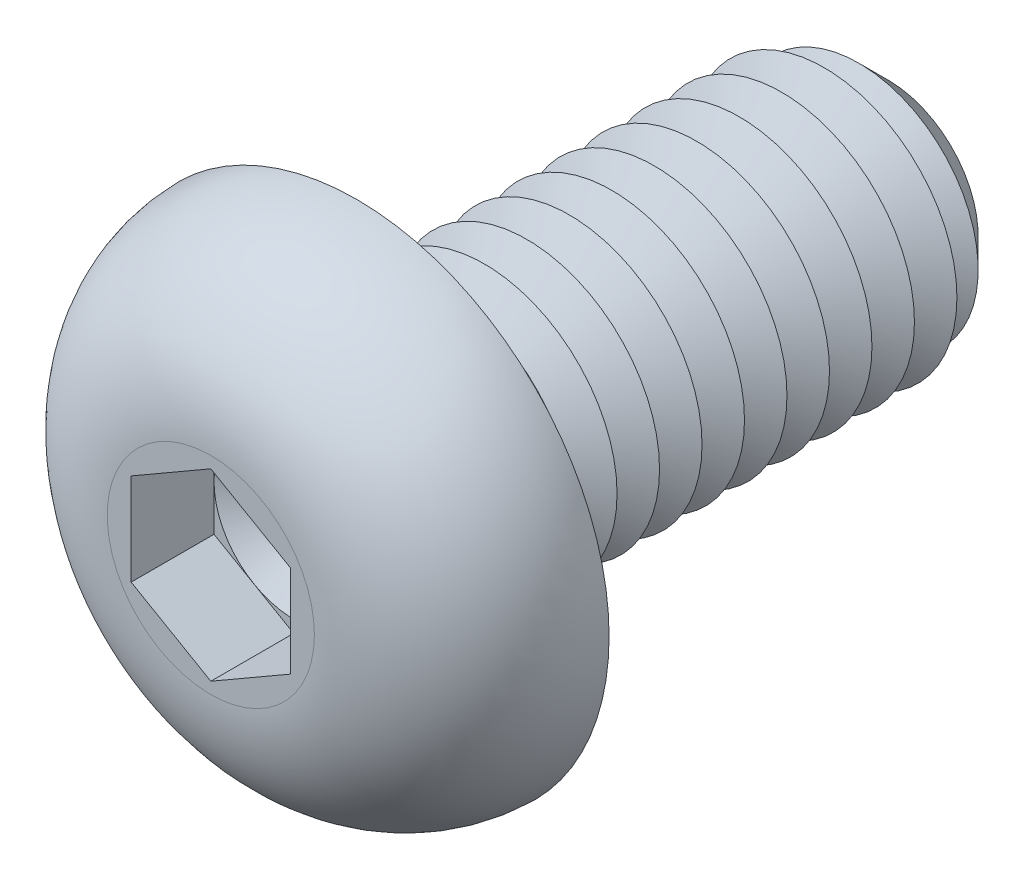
ISO-10303-21;
HEADER;
FILE_DESCRIPTION(('STEP AP214'),'2;1');
FILE_NAME('part.step','',(''),(''),'','','');
FILE_SCHEMA(('AUTOMOTIVE_DESIGN { 1 0 10303 214 1 1 1 1 }'));
ENDSEC;
DATA;
#1=APPLICATION_CONTEXT('core data for automotive mechanical design processes');
#2=APPLICATION_PROTOCOL_DEFINITION('international standard','automotive_design',2000,#1);
#3=PRODUCT_CONTEXT('',#1,'mechanical');
#4=PRODUCT('Part','Part','',(#3));
#5=PRODUCT_RELATED_PRODUCT_CATEGORY('part','',(#4));
#6=PRODUCT_DEFINITION_FORMATION('','',#4);
#7=PRODUCT_DEFINITION_CONTEXT('part definition',#1,'design');
#8=PRODUCT_DEFINITION('design','',#6,#7);
#9=PRODUCT_DEFINITION_SHAPE('','',#8);
#10=(LENGTH_UNIT() NAMED_UNIT(*) SI_UNIT(.MILLI.,.METRE.));
#11=(NAMED_UNIT(*) PLANE_ANGLE_UNIT() SI_UNIT($,.RADIAN.));
#12=(NAMED_UNIT(*) SI_UNIT($,.STERADIAN.) SOLID_ANGLE_UNIT());
#13=UNCERTAINTY_MEASURE_WITH_UNIT(LENGTH_MEASURE(1.E-05),#10,'distance_accuracy_value','');
#14=(GEOMETRIC_REPRESENTATION_CONTEXT(3) GLOBAL_UNCERTAINTY_ASSIGNED_CONTEXT((#13)) GLOBAL_UNIT_ASSIGNED_CONTEXT((#10,
#11,#12)) REPRESENTATION_CONTEXT('',''));
#15=CARTESIAN_POINT('',(0.,0.,0.));
#16=DIRECTION('',(0.,0.,1.));
#17=DIRECTION('',(1.,0.,0.));
#18=AXIS2_PLACEMENT_3D('',#15,#16,#17);
#19=CARTESIAN_POINT('',(0.,0.,1.19));
#20=DIRECTION('',(0.,0.,1.));
#21=DIRECTION('',(1.,0.,0.));
#22=AXIS2_PLACEMENT_3D('',#19,#20,#21);
#23=PLANE('',#22);
#24=CARTESIAN_POINT('',(0.,0.,1.19));
#25=DIRECTION('',(0.,0.,1.));
#26=DIRECTION('',(1.,0.,0.));
#27=AXIS2_PLACEMENT_3D('',#24,#25,#26);
#28=CIRCLE('',#27,1.5);
#29=CARTESIAN_POINT('',(1.5,0.,1.19));
#30=VERTEX_POINT('',#29);
#31=CARTESIAN_POINT('',(0.75,1.29903810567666,1.19));
#32=VERTEX_POINT('',#31);
#33=EDGE_CURVE('E117',#30,#32,#28,.T.);
#34=ORIENTED_EDGE('',*,*,#33,.F.);
#35=DIRECTION('',(0.,1.,0.));
#36=VECTOR('',#35,1.);
#37=CARTESIAN_POINT('',(1.5,-0.866025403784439,1.19));
#38=LINE('',#37,#36);
#39=CARTESIAN_POINT('',(1.5,0.86602540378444,1.19));
#40=VERTEX_POINT('',#39);
#41=EDGE_CURVE('E140',#30,#40,#38,.T.);
#42=ORIENTED_EDGE('',*,*,#41,.T.);
#43=DIRECTION('',(-0.866025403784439,0.5,0.));
#44=VECTOR('',#43,1.);
#45=CARTESIAN_POINT('',(1.5,0.86602540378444,1.19));
#46=LINE('',#45,#44);
#47=EDGE_CURVE('E135',#40,#32,#46,.T.);
#48=ORIENTED_EDGE('',*,*,#47,.T.);
#49=EDGE_LOOP('',(#34,#42,#48));
#50=FACE_BOUND('',#49,.T.);
#51=ADVANCED_FACE('F39',(#50),#23,.T.);
#52=CARTESIAN_POINT('',(0.,0.,1.19));
#53=DIRECTION('',(0.,0.,1.));
#54=DIRECTION('',(1.,0.,0.));
#55=AXIS2_PLACEMENT_3D('',#52,#53,#54);
#56=CIRCLE('',#55,1.5);
#57=CARTESIAN_POINT('',(-0.75,1.29903810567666,1.19));
#58=VERTEX_POINT('',#57);
#59=EDGE_CURVE('E11',#32,#58,#56,.T.);
#60=ORIENTED_EDGE('',*,*,#59,.F.);
#61=CARTESIAN_POINT('',(0.,1.73205080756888,1.19));
#62=VERTEX_POINT('',#61);
#63=EDGE_CURVE('E130',#32,#62,#46,.T.);
#64=ORIENTED_EDGE('',*,*,#63,.T.);
#65=DIRECTION('',(-0.866025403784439,-0.5,0.));
#66=VECTOR('',#65,1.);
#67=CARTESIAN_POINT('',(0.,1.73205080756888,1.19));
#68=LINE('',#67,#66);
#69=EDGE_CURVE('E132',#62,#58,#68,.T.);
#70=ORIENTED_EDGE('',*,*,#69,.T.);
#71=EDGE_LOOP('',(#60,#64,#70));
#72=FACE_BOUND('',#71,.T.);
#73=ADVANCED_FACE('F129',(#72),#23,.T.);
#74=CARTESIAN_POINT('',(-1.5,0.,1.19));
#75=VERTEX_POINT('',#74);
#76=EDGE_CURVE('E49',#58,#75,#56,.T.);
#77=ORIENTED_EDGE('',*,*,#76,.F.);
#78=CARTESIAN_POINT('',(-1.5,0.866025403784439,1.19));
#79=VERTEX_POINT('',#78);
#80=EDGE_CURVE('E143',#58,#79,#68,.T.);
#81=ORIENTED_EDGE('',*,*,#80,.T.);
#82=DIRECTION('',(0.,-1.,0.));
#83=VECTOR('',#82,1.);
#84=CARTESIAN_POINT('',(-1.5,0.866025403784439,1.19));
#85=LINE('',#84,#83);
#86=EDGE_CURVE('E154',#79,#75,#85,.T.);
#87=ORIENTED_EDGE('',*,*,#86,.T.);
#88=EDGE_LOOP('',(#77,#81,#87));
#89=FACE_BOUND('',#88,.T.);
#90=ADVANCED_FACE('F254',(#89),#23,.T.);
#91=CARTESIAN_POINT('',(-0.75,-1.29903810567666,1.19));
#92=VERTEX_POINT('',#91);
#93=EDGE_CURVE('E238',#75,#92,#56,.T.);
#94=ORIENTED_EDGE('',*,*,#93,.F.);
#95=CARTESIAN_POINT('',(-1.5,-0.866025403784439,1.19));
#96=VERTEX_POINT('',#95);
#97=EDGE_CURVE('E153',#75,#96,#85,.T.);
#98=ORIENTED_EDGE('',*,*,#97,.T.);
#99=DIRECTION('',(0.866025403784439,-0.5,0.));
#100=VECTOR('',#99,1.);
#101=CARTESIAN_POINT('',(-1.5,-0.866025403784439,1.19));
#102=LINE('',#101,#100);
#103=EDGE_CURVE('E159',#96,#92,#102,.T.);
#104=ORIENTED_EDGE('',*,*,#103,.T.);
#105=EDGE_LOOP('',(#94,#98,#104));
#106=FACE_BOUND('',#105,.T.);
#107=ADVANCED_FACE('F247',(#106),#23,.T.);
#108=CARTESIAN_POINT('',(0.75,-1.29903810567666,1.19));
#109=VERTEX_POINT('',#108);
#110=EDGE_CURVE('E56',#92,#109,#56,.T.);
#111=ORIENTED_EDGE('',*,*,#110,.F.);
#112=CARTESIAN_POINT('',(0.,-1.73205080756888,1.19));
#113=VERTEX_POINT('',#112);
#114=EDGE_CURVE('E158',#92,#113,#102,.T.);
#115=ORIENTED_EDGE('',*,*,#114,.T.);
#116=DIRECTION('',(0.866025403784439,0.5,0.));
#117=VECTOR('',#116,1.);
#118=CARTESIAN_POINT('',(0.,-1.73205080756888,1.19));
#119=LINE('',#118,#117);
#120=EDGE_CURVE('E164',#113,#109,#119,.T.);
#121=ORIENTED_EDGE('',*,*,#120,.T.);
#122=EDGE_LOOP('',(#111,#115,#121));
#123=FACE_BOUND('',#122,.T.);
#124=ADVANCED_FACE('F386',(#123),#23,.T.);
#125=CARTESIAN_POINT('',(0.,0.,-10.));
#126=DIRECTION('',(0.,0.,1.));
#127=DIRECTION('',(1.,0.,0.));
#128=AXIS2_PLACEMENT_3D('',#125,#126,#127);
#129=CYLINDRICAL_SURFACE('',#128,2.5);
#130=CARTESIAN_POINT('',(0.,0.,-0.399999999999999));
#131=DIRECTION('',(0.,0.,1.));
#132=DIRECTION('',(1.,0.,0.));
#133=AXIS2_PLACEMENT_3D('',#130,#131,#132);
#134=CIRCLE('',#133,2.5);
#135=CARTESIAN_POINT('',(2.5,0.,-0.399999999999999));
#136=VERTEX_POINT('',#135);
#137=EDGE_CURVE('E222',#136,#136,#134,.F.);
#138=ORIENTED_EDGE('',*,*,#137,.T.);
#139=EDGE_LOOP('',(#138));
#140=FACE_BOUND('',#139,.T.);
#141=CARTESIAN_POINT('',(0.,0.,-0.800000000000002));
#142=DIRECTION('',(0.,0.,1.));
#143=DIRECTION('',(1.,0.,0.));
#144=AXIS2_PLACEMENT_3D('',#141,#142,#143);
#145=CIRCLE('',#144,2.5);
#146=CARTESIAN_POINT('',(2.5,0.,-0.800000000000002));
#147=VERTEX_POINT('',#146);
#148=EDGE_CURVE('E149',#147,#147,#145,.T.);
#149=ORIENTED_EDGE('',*,*,#148,.T.);
#150=EDGE_LOOP('',(#149));
#151=FACE_BOUND('',#150,.T.);
#152=ADVANCED_FACE('F395',(#140,#151),#129,.T.);
#153=CARTESIAN_POINT('',(0.,4.75,0.));
#154=DIRECTION('',(0.,0.,1.));
#155=DIRECTION('',(1.,0.,0.));
#156=AXIS2_PLACEMENT_3D('',#153,#154,#155);
#157=PLANE('',#156);
#158=CARTESIAN_POINT('',(0.,0.,0.));
#159=DIRECTION('',(0.,0.,1.));
#160=DIRECTION('',(1.,0.,0.));
#161=AXIS2_PLACEMENT_3D('',#158,#159,#160);
#162=CIRCLE('',#161,2.9);
#163=CARTESIAN_POINT('',(2.9,0.,0.));
#164=VERTEX_POINT('',#163);
#165=EDGE_CURVE('E230',#164,#164,#162,.T.);
#166=ORIENTED_EDGE('',*,*,#165,.T.);
#167=EDGE_LOOP('',(#166));
#168=FACE_BOUND('',#167,.T.);
#169=CARTESIAN_POINT('',(0.,0.,0.));
#170=DIRECTION('',(0.,0.,1.));
#171=DIRECTION('',(1.,0.,0.));
#172=AXIS2_PLACEMENT_3D('',#169,#170,#171);
#173=CIRCLE('',#172,4.75);
#174=CARTESIAN_POINT('',(4.75,0.,0.));
#175=VERTEX_POINT('',#174);
#176=EDGE_CURVE('E196',#175,#175,#173,.T.);
#177=ORIENTED_EDGE('',*,*,#176,.F.);
#178=EDGE_LOOP('',(#177));
#179=FACE_BOUND('',#178,.T.);
#180=ADVANCED_FACE('F400',(#168,#179),#157,.F.);
#181=CARTESIAN_POINT('',(0.,0.,2.75));
#182=DIRECTION('',(0.,0.,-1.));
#183=DIRECTION('',(-1.,0.,0.));
#184=AXIS2_PLACEMENT_3D('',#181,#182,#183);
#185=PLANE('',#184);
#186=DIRECTION('',(-0.866025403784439,-0.5,0.));
#187=VECTOR('',#186,1.);
#188=CARTESIAN_POINT('',(0.,1.73205080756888,2.75));
#189=LINE('',#188,#187);
#190=CARTESIAN_POINT('',(0.,1.73205080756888,2.75));
#191=VERTEX_POINT('',#190);
#192=CARTESIAN_POINT('',(-1.5,0.866025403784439,2.75));
#193=VERTEX_POINT('',#192);
#194=EDGE_CURVE('E174',#191,#193,#189,.T.);
#195=ORIENTED_EDGE('',*,*,#194,.F.);
#196=DIRECTION('',(-0.866025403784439,0.5,0.));
#197=VECTOR('',#196,1.);
#198=CARTESIAN_POINT('',(1.5,0.86602540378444,2.75));
#199=LINE('',#198,#197);
#200=CARTESIAN_POINT('',(1.5,0.86602540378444,2.75));
#201=VERTEX_POINT('',#200);
#202=EDGE_CURVE('E64',#201,#191,#199,.T.);
#203=ORIENTED_EDGE('',*,*,#202,.F.);
#204=DIRECTION('',(0.,1.,0.));
#205=VECTOR('',#204,1.);
#206=CARTESIAN_POINT('',(1.5,-0.866025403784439,2.75));
#207=LINE('',#206,#205);
#208=CARTESIAN_POINT('',(1.5,-0.866025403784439,2.75));
#209=VERTEX_POINT('',#208);
#210=EDGE_CURVE('E138',#209,#201,#207,.T.);
#211=ORIENTED_EDGE('',*,*,#210,.F.);
#212=DIRECTION('',(0.866025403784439,0.5,0.));
#213=VECTOR('',#212,1.);
#214=CARTESIAN_POINT('',(0.,-1.73205080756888,2.75));
#215=LINE('',#214,#213);
#216=CARTESIAN_POINT('',(0.,-1.73205080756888,2.75));
#217=VERTEX_POINT('',#216);
#218=EDGE_CURVE('E186',#217,#209,#215,.T.);
#219=ORIENTED_EDGE('',*,*,#218,.F.);
#220=DIRECTION('',(0.866025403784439,-0.5,0.));
#221=VECTOR('',#220,1.);
#222=CARTESIAN_POINT('',(-1.5,-0.866025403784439,2.75));
#223=LINE('',#222,#221);
#224=CARTESIAN_POINT('',(-1.5,-0.866025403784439,2.75));
#225=VERTEX_POINT('',#224);
#226=EDGE_CURVE('E182',#225,#217,#223,.T.);
#227=ORIENTED_EDGE('',*,*,#226,.F.);
#228=DIRECTION('',(0.,-1.,0.));
#229=VECTOR('',#228,1.);
#230=CARTESIAN_POINT('',(-1.5,0.866025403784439,2.75));
#231=LINE('',#230,#229);
#232=EDGE_CURVE('E178',#193,#225,#231,.T.);
#233=ORIENTED_EDGE('',*,*,#232,.F.);
#234=EDGE_LOOP('',(#195,#203,#211,#219,#227,#233));
#235=FACE_BOUND('',#234,.T.);
#236=CARTESIAN_POINT('',(0.,0.,2.75));
#237=DIRECTION('',(0.,0.,1.));
#238=DIRECTION('',(1.,0.,0.));
#239=AXIS2_PLACEMENT_3D('',#236,#237,#238);
#240=CIRCLE('',#239,1.95044646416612);
#241=CARTESIAN_POINT('',(1.95044646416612,0.,2.75));
#242=VERTEX_POINT('',#241);
#243=EDGE_CURVE('E214',#242,#242,#240,.T.);
#244=ORIENTED_EDGE('',*,*,#243,.T.);
#245=EDGE_LOOP('',(#244));
#246=FACE_BOUND('',#245,.T.);
#247=ADVANCED_FACE('F263',(#235,#246),#185,.F.);
#248=CARTESIAN_POINT('',(0.,0.,-0.0500000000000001));
#249=DIRECTION('',(0.,0.,1.));
#250=DIRECTION('',(1.,0.,0.));
#251=AXIS2_PLACEMENT_3D('',#248,#249,#250);
#252=DEGENERATE_TOROIDAL_SURFACE('',#251,1.95044646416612,2.8,.T.);
#253=ORIENTED_EDGE('',*,*,#243,.F.);
#254=EDGE_LOOP('',(#253));
#255=FACE_BOUND('',#254,.T.);
#256=ORIENTED_EDGE('',*,*,#176,.T.);
#257=EDGE_LOOP('',(#256));
#258=FACE_BOUND('',#257,.T.);
#259=ADVANCED_FACE('F416',(#255,#258),#252,.T.);
#260=CARTESIAN_POINT('',(1.5,0.86602540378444,1.19));
#261=DIRECTION('',(0.5,0.866025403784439,0.));
#262=DIRECTION('',(-0.866025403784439,0.5,0.));
#263=AXIS2_PLACEMENT_3D('',#260,#261,#262);
#264=PLANE('',#263);
#265=ORIENTED_EDGE('',*,*,#202,.T.);
#266=DIRECTION('',(0.,0.,1.));
#267=VECTOR('',#266,1.);
#268=CARTESIAN_POINT('',(0.,1.73205080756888,1.19));
#269=LINE('',#268,#267);
#270=EDGE_CURVE('E136',#62,#191,#269,.T.);
#271=ORIENTED_EDGE('',*,*,#270,.F.);
#272=ORIENTED_EDGE('',*,*,#63,.F.);
#273=ORIENTED_EDGE('',*,*,#47,.F.);
#274=DIRECTION('',(0.,0.,1.));
#275=VECTOR('',#274,1.);
#276=CARTESIAN_POINT('',(1.5,0.86602540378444,1.19));
#277=LINE('',#276,#275);
#278=EDGE_CURVE('E193',#40,#201,#277,.T.);
#279=ORIENTED_EDGE('',*,*,#278,.T.);
#280=EDGE_LOOP('',(#265,#271,#272,#273,#279));
#281=FACE_BOUND('',#280,.T.);
#282=ADVANCED_FACE('F134',(#281),#264,.F.);
#283=CARTESIAN_POINT('',(1.5,-0.866025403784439,1.19));
#284=DIRECTION('',(1.,0.,0.));
#285=DIRECTION('',(0.,1.,0.));
#286=AXIS2_PLACEMENT_3D('',#283,#284,#285);
#287=PLANE('',#286);
#288=ORIENTED_EDGE('',*,*,#210,.T.);
#289=ORIENTED_EDGE('',*,*,#278,.F.);
#290=ORIENTED_EDGE('',*,*,#41,.F.);
#291=CARTESIAN_POINT('',(1.5,-0.866025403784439,1.19));
#292=VERTEX_POINT('',#291);
#293=EDGE_CURVE('E168',#292,#30,#38,.T.);
#294=ORIENTED_EDGE('',*,*,#293,.F.);
#295=DIRECTION('',(0.,0.,1.));
#296=VECTOR('',#295,1.);
#297=CARTESIAN_POINT('',(1.5,-0.866025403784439,1.19));
#298=LINE('',#297,#296);
#299=EDGE_CURVE('E197',#292,#209,#298,.T.);
#300=ORIENTED_EDGE('',*,*,#299,.T.);
#301=EDGE_LOOP('',(#288,#289,#290,#294,#300));
#302=FACE_BOUND('',#301,.T.);
#303=ADVANCED_FACE('F409',(#302),#287,.F.);
#304=CARTESIAN_POINT('',(0.,-1.73205080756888,1.19));
#305=DIRECTION('',(0.5,-0.866025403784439,0.));
#306=DIRECTION('',(0.866025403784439,0.5,0.));
#307=AXIS2_PLACEMENT_3D('',#304,#305,#306);
#308=PLANE('',#307);
#309=ORIENTED_EDGE('',*,*,#218,.T.);
#310=ORIENTED_EDGE('',*,*,#299,.F.);
#311=EDGE_CURVE('E163',#109,#292,#119,.T.);
#312=ORIENTED_EDGE('',*,*,#311,.F.);
#313=ORIENTED_EDGE('',*,*,#120,.F.);
#314=DIRECTION('',(0.,0.,1.));
#315=VECTOR('',#314,1.);
#316=CARTESIAN_POINT('',(0.,-1.73205080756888,1.19));
#317=LINE('',#316,#315);
#318=EDGE_CURVE('E200',#113,#217,#317,.T.);
#319=ORIENTED_EDGE('',*,*,#318,.T.);
#320=EDGE_LOOP('',(#309,#310,#312,#313,#319));
#321=FACE_BOUND('',#320,.T.);
#322=ADVANCED_FACE('F404',(#321),#308,.F.);
#323=CARTESIAN_POINT('',(-1.5,-0.866025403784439,1.19));
#324=DIRECTION('',(-0.5,-0.866025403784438,0.));
#325=DIRECTION('',(0.866025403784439,-0.5,0.));
#326=AXIS2_PLACEMENT_3D('',#323,#324,#325);
#327=PLANE('',#326);
#328=ORIENTED_EDGE('',*,*,#226,.T.);
#329=ORIENTED_EDGE('',*,*,#318,.F.);
#330=ORIENTED_EDGE('',*,*,#114,.F.);
#331=ORIENTED_EDGE('',*,*,#103,.F.);
#332=DIRECTION('',(0.,0.,1.));
#333=VECTOR('',#332,1.);
#334=CARTESIAN_POINT('',(-1.5,-0.866025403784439,1.19));
#335=LINE('',#334,#333);
#336=EDGE_CURVE('E203',#96,#225,#335,.T.);
#337=ORIENTED_EDGE('',*,*,#336,.T.);
#338=EDGE_LOOP('',(#328,#329,#330,#331,#337));
#339=FACE_BOUND('',#338,.T.);
#340=ADVANCED_FACE('F268',(#339),#327,.F.);
#341=CARTESIAN_POINT('',(-1.5,0.866025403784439,1.19));
#342=DIRECTION('',(-1.,0.,0.));
#343=DIRECTION('',(0.,-1.,0.));
#344=AXIS2_PLACEMENT_3D('',#341,#342,#343);
#345=PLANE('',#344);
#346=ORIENTED_EDGE('',*,*,#232,.T.);
#347=ORIENTED_EDGE('',*,*,#336,.F.);
#348=ORIENTED_EDGE('',*,*,#97,.F.);
#349=ORIENTED_EDGE('',*,*,#86,.F.);
#350=DIRECTION('',(0.,0.,1.));
#351=VECTOR('',#350,1.);
#352=CARTESIAN_POINT('',(-1.5,0.866025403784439,1.19));
#353=LINE('',#352,#351);
#354=EDGE_CURVE('E206',#79,#193,#353,.T.);
#355=ORIENTED_EDGE('',*,*,#354,.T.);
#356=EDGE_LOOP('',(#346,#347,#348,#349,#355));
#357=FACE_BOUND('',#356,.T.);
#358=ADVANCED_FACE('F252',(#357),#345,.F.);
#359=CARTESIAN_POINT('',(0.,1.73205080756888,1.19));
#360=DIRECTION('',(-0.5,0.866025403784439,0.));
#361=DIRECTION('',(-0.866025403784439,-0.5,0.));
#362=AXIS2_PLACEMENT_3D('',#359,#360,#361);
#363=PLANE('',#362);
#364=ORIENTED_EDGE('',*,*,#194,.T.);
#365=ORIENTED_EDGE('',*,*,#354,.F.);
#366=ORIENTED_EDGE('',*,*,#80,.F.);
#367=ORIENTED_EDGE('',*,*,#69,.F.);
#368=ORIENTED_EDGE('',*,*,#270,.T.);
#369=EDGE_LOOP('',(#364,#365,#366,#367,#368));
#370=FACE_BOUND('',#369,.T.);
#371=ADVANCED_FACE('F257',(#370),#363,.F.);
#372=EDGE_CURVE('E43',#109,#30,#56,.T.);
#373=ORIENTED_EDGE('',*,*,#372,.F.);
#374=ORIENTED_EDGE('',*,*,#311,.T.);
#375=ORIENTED_EDGE('',*,*,#293,.T.);
#376=EDGE_LOOP('',(#373,#374,#375));
#377=FACE_BOUND('',#376,.T.);
#378=ADVANCED_FACE('F377',(#377),#23,.T.);
#379=CARTESIAN_POINT('',(0.,0.,-0.800000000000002));
#380=DIRECTION('',(0.,0.,1.));
#381=DIRECTION('',(1.,0.,0.));
#382=AXIS2_PLACEMENT_3D('',#379,#380,#381);
#383=CONICAL_SURFACE('',#382,2.5,1.0471975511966);
#384=CARTESIAN_POINT('',(0.,0.,-1.2));
#385=DIRECTION('',(0.,0.,1.));
#386=DIRECTION('',(1.,0.,0.));
#387=AXIS2_PLACEMENT_3D('',#384,#385,#386);
#388=CIRCLE('',#387,1.80717967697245);
#389=CARTESIAN_POINT('',(1.80717967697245,0.,-1.2));
#390=VERTEX_POINT('',#389);
#391=EDGE_CURVE('E287',#390,#390,#388,.T.);
#392=ORIENTED_EDGE('',*,*,#391,.T.);
#393=EDGE_LOOP('',(#392));
#394=FACE_BOUND('',#393,.T.);
#395=ORIENTED_EDGE('',*,*,#148,.F.);
#396=EDGE_LOOP('',(#395));
#397=FACE_BOUND('',#396,.T.);
#398=ADVANCED_FACE('F384',(#394,#397),#383,.T.);
#399=CARTESIAN_POINT('',(0.,0.,-1.2));
#400=DIRECTION('',(0.,0.,-1.));
#401=DIRECTION('',(-1.,0.,0.));
#402=AXIS2_PLACEMENT_3D('',#399,#400,#401);
#403=CONICAL_SURFACE('',#402,1.80717967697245,1.04719755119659);
#404=CARTESIAN_POINT('',(0.,0.,-1.6));
#405=DIRECTION('',(0.,0.,1.));
#406=DIRECTION('',(1.,0.,0.));
#407=AXIS2_PLACEMENT_3D('',#404,#405,#406);
#408=CIRCLE('',#407,2.5);
#409=CARTESIAN_POINT('',(2.5,0.,-1.6));
#410=VERTEX_POINT('',#409);
#411=EDGE_CURVE('E289',#410,#410,#408,.T.);
#412=ORIENTED_EDGE('',*,*,#411,.T.);
#413=EDGE_LOOP('',(#412));
#414=FACE_BOUND('',#413,.T.);
#415=ORIENTED_EDGE('',*,*,#391,.F.);
#416=EDGE_LOOP('',(#415));
#417=FACE_BOUND('',#416,.T.);
#418=ADVANCED_FACE('F391',(#414,#417),#403,.T.);
#419=CARTESIAN_POINT('',(0.,0.,-1.6));
#420=DIRECTION('',(0.,0.,1.));
#421=DIRECTION('',(1.,0.,0.));
#422=AXIS2_PLACEMENT_3D('',#419,#420,#421);
#423=CONICAL_SURFACE('',#422,2.5,1.0471975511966);
#424=CARTESIAN_POINT('',(0.,0.,-2.));
#425=DIRECTION('',(0.,0.,1.));
#426=DIRECTION('',(1.,0.,0.));
#427=AXIS2_PLACEMENT_3D('',#424,#425,#426);
#428=CIRCLE('',#427,1.80717967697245);
#429=CARTESIAN_POINT('',(1.80717967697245,0.,-2.));
#430=VERTEX_POINT('',#429);
#431=EDGE_CURVE('E296',#430,#430,#428,.T.);
#432=ORIENTED_EDGE('',*,*,#431,.T.);
#433=EDGE_LOOP('',(#432));
#434=FACE_BOUND('',#433,.T.);
#435=ORIENTED_EDGE('',*,*,#411,.F.);
#436=EDGE_LOOP('',(#435));
#437=FACE_BOUND('',#436,.T.);
#438=ADVANCED_FACE('F729',(#434,#437),#423,.T.);
#439=CARTESIAN_POINT('',(0.,0.,-2.));
#440=DIRECTION('',(0.,0.,-1.));
#441=DIRECTION('',(-1.,0.,0.));
#442=AXIS2_PLACEMENT_3D('',#439,#440,#441);
#443=CONICAL_SURFACE('',#442,1.80717967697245,1.04719755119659);
#444=CARTESIAN_POINT('',(0.,0.,-2.4));
#445=DIRECTION('',(0.,0.,1.));
#446=DIRECTION('',(1.,0.,0.));
#447=AXIS2_PLACEMENT_3D('',#444,#445,#446);
#448=CIRCLE('',#447,2.5);
#449=CARTESIAN_POINT('',(2.5,0.,-2.4));
#450=VERTEX_POINT('',#449);
#451=EDGE_CURVE('E277',#450,#450,#448,.T.);
#452=ORIENTED_EDGE('',*,*,#451,.T.);
#453=EDGE_LOOP('',(#452));
#454=FACE_BOUND('',#453,.T.);
#455=ORIENTED_EDGE('',*,*,#431,.F.);
#456=EDGE_LOOP('',(#455));
#457=FACE_BOUND('',#456,.T.);
#458=ADVANCED_FACE('F719',(#454,#457),#443,.T.);
#459=CARTESIAN_POINT('',(0.,0.,-2.4));
#460=DIRECTION('',(0.,0.,1.));
#461=DIRECTION('',(1.,0.,0.));
#462=AXIS2_PLACEMENT_3D('',#459,#460,#461);
#463=CONICAL_SURFACE('',#462,2.5,1.0471975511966);
#464=CARTESIAN_POINT('',(0.,0.,-2.8));
#465=DIRECTION('',(0.,0.,1.));
#466=DIRECTION('',(1.,0.,0.));
#467=AXIS2_PLACEMENT_3D('',#464,#465,#466);
#468=CIRCLE('',#467,1.80717967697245);
#469=CARTESIAN_POINT('',(1.80717967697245,0.,-2.8));
#470=VERTEX_POINT('',#469);
#471=EDGE_CURVE('E275',#470,#470,#468,.T.);
#472=ORIENTED_EDGE('',*,*,#471,.T.);
#473=EDGE_LOOP('',(#472));
#474=FACE_BOUND('',#473,.T.);
#475=ORIENTED_EDGE('',*,*,#451,.F.);
#476=EDGE_LOOP('',(#475));
#477=FACE_BOUND('',#476,.T.);
#478=ADVANCED_FACE('F709',(#474,#477),#463,.T.);
#479=CARTESIAN_POINT('',(0.,0.,-2.8));
#480=DIRECTION('',(0.,0.,-1.));
#481=DIRECTION('',(-1.,0.,0.));
#482=AXIS2_PLACEMENT_3D('',#479,#480,#481);
#483=CONICAL_SURFACE('',#482,1.80717967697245,1.04719755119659);
#484=CARTESIAN_POINT('',(0.,0.,-3.2));
#485=DIRECTION('',(0.,0.,1.));
#486=DIRECTION('',(1.,0.,0.));
#487=AXIS2_PLACEMENT_3D('',#484,#485,#486);
#488=CIRCLE('',#487,2.5);
#489=CARTESIAN_POINT('',(2.5,0.,-3.2));
#490=VERTEX_POINT('',#489);
#491=EDGE_CURVE('E278',#490,#490,#488,.T.);
#492=ORIENTED_EDGE('',*,*,#491,.T.);
#493=EDGE_LOOP('',(#492));
#494=FACE_BOUND('',#493,.T.);
#495=ORIENTED_EDGE('',*,*,#471,.F.);
#496=EDGE_LOOP('',(#495));
#497=FACE_BOUND('',#496,.T.);
#498=ADVANCED_FACE('F699',(#494,#497),#483,.T.);
#499=CARTESIAN_POINT('',(0.,0.,-3.2));
#500=DIRECTION('',(0.,0.,1.));
#501=DIRECTION('',(1.,0.,0.));
#502=AXIS2_PLACEMENT_3D('',#499,#500,#501);
#503=CONICAL_SURFACE('',#502,2.5,1.0471975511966);
#504=CARTESIAN_POINT('',(0.,0.,-3.6));
#505=DIRECTION('',(0.,0.,1.));
#506=DIRECTION('',(1.,0.,0.));
#507=AXIS2_PLACEMENT_3D('',#504,#505,#506);
#508=CIRCLE('',#507,1.80717967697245);
#509=CARTESIAN_POINT('',(1.80717967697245,0.,-3.6));
#510=VERTEX_POINT('',#509);
#511=EDGE_CURVE('E308',#510,#510,#508,.T.);
#512=ORIENTED_EDGE('',*,*,#511,.T.);
#513=EDGE_LOOP('',(#512));
#514=FACE_BOUND('',#513,.T.);
#515=ORIENTED_EDGE('',*,*,#491,.F.);
#516=EDGE_LOOP('',(#515));
#517=FACE_BOUND('',#516,.T.);
#518=ADVANCED_FACE('F689',(#514,#517),#503,.T.);
#519=CARTESIAN_POINT('',(0.,0.,-3.6));
#520=DIRECTION('',(0.,0.,-1.));
#521=DIRECTION('',(-1.,0.,0.));
#522=AXIS2_PLACEMENT_3D('',#519,#520,#521);
#523=CONICAL_SURFACE('',#522,1.80717967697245,1.04719755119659);
#524=CARTESIAN_POINT('',(0.,0.,-4.));
#525=DIRECTION('',(0.,0.,1.));
#526=DIRECTION('',(1.,0.,0.));
#527=AXIS2_PLACEMENT_3D('',#524,#525,#526);
#528=CIRCLE('',#527,2.5);
#529=CARTESIAN_POINT('',(2.5,0.,-4.));
#530=VERTEX_POINT('',#529);
#531=EDGE_CURVE('E312',#530,#530,#528,.T.);
#532=ORIENTED_EDGE('',*,*,#531,.T.);
#533=EDGE_LOOP('',(#532));
#534=FACE_BOUND('',#533,.T.);
#535=ORIENTED_EDGE('',*,*,#511,.F.);
#536=EDGE_LOOP('',(#535));
#537=FACE_BOUND('',#536,.T.);
#538=ADVANCED_FACE('F679',(#534,#537),#523,.T.);
#539=CARTESIAN_POINT('',(0.,0.,-4.));
#540=DIRECTION('',(0.,0.,1.));
#541=DIRECTION('',(1.,0.,0.));
#542=AXIS2_PLACEMENT_3D('',#539,#540,#541);
#543=CONICAL_SURFACE('',#542,2.5,1.0471975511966);
#544=CARTESIAN_POINT('',(0.,0.,-4.4));
#545=DIRECTION('',(0.,0.,1.));
#546=DIRECTION('',(1.,0.,0.));
#547=AXIS2_PLACEMENT_3D('',#544,#545,#546);
#548=CIRCLE('',#547,1.80717967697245);
#549=CARTESIAN_POINT('',(1.80717967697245,0.,-4.4));
#550=VERTEX_POINT('',#549);
#551=EDGE_CURVE('E315',#550,#550,#548,.T.);
#552=ORIENTED_EDGE('',*,*,#551,.T.);
#553=EDGE_LOOP('',(#552));
#554=FACE_BOUND('',#553,.T.);
#555=ORIENTED_EDGE('',*,*,#531,.F.);
#556=EDGE_LOOP('',(#555));
#557=FACE_BOUND('',#556,.T.);
#558=ADVANCED_FACE('F669',(#554,#557),#543,.T.);
#559=CARTESIAN_POINT('',(0.,0.,-4.4));
#560=DIRECTION('',(0.,0.,-1.));
#561=DIRECTION('',(-1.,0.,0.));
#562=AXIS2_PLACEMENT_3D('',#559,#560,#561);
#563=CONICAL_SURFACE('',#562,1.80717967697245,1.04719755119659);
#564=CARTESIAN_POINT('',(0.,0.,-4.8));
#565=DIRECTION('',(0.,0.,1.));
#566=DIRECTION('',(1.,0.,0.));
#567=AXIS2_PLACEMENT_3D('',#564,#565,#566);
#568=CIRCLE('',#567,2.5);
#569=CARTESIAN_POINT('',(2.5,0.,-4.8));
#570=VERTEX_POINT('',#569);
#571=EDGE_CURVE('E319',#570,#570,#568,.T.);
#572=ORIENTED_EDGE('',*,*,#571,.T.);
#573=EDGE_LOOP('',(#572));
#574=FACE_BOUND('',#573,.T.);
#575=ORIENTED_EDGE('',*,*,#551,.F.);
#576=EDGE_LOOP('',(#575));
#577=FACE_BOUND('',#576,.T.);
#578=ADVANCED_FACE('F659',(#574,#577),#563,.T.);
#579=CARTESIAN_POINT('',(0.,0.,-4.8));
#580=DIRECTION('',(0.,0.,1.));
#581=DIRECTION('',(1.,0.,0.));
#582=AXIS2_PLACEMENT_3D('',#579,#580,#581);
#583=CONICAL_SURFACE('',#582,2.5,1.0471975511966);
#584=CARTESIAN_POINT('',(0.,0.,-5.2));
#585=DIRECTION('',(0.,0.,1.));
#586=DIRECTION('',(1.,0.,0.));
#587=AXIS2_PLACEMENT_3D('',#584,#585,#586);
#588=CIRCLE('',#587,1.80717967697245);
#589=CARTESIAN_POINT('',(1.80717967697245,0.,-5.2));
#590=VERTEX_POINT('',#589);
#591=EDGE_CURVE('E323',#590,#590,#588,.T.);
#592=ORIENTED_EDGE('',*,*,#591,.T.);
#593=EDGE_LOOP('',(#592));
#594=FACE_BOUND('',#593,.T.);
#595=ORIENTED_EDGE('',*,*,#571,.F.);
#596=EDGE_LOOP('',(#595));
#597=FACE_BOUND('',#596,.T.);
#598=ADVANCED_FACE('F649',(#594,#597),#583,.T.);
#599=CARTESIAN_POINT('',(0.,0.,-5.2));
#600=DIRECTION('',(0.,0.,-1.));
#601=DIRECTION('',(-1.,0.,0.));
#602=AXIS2_PLACEMENT_3D('',#599,#600,#601);
#603=CONICAL_SURFACE('',#602,1.80717967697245,1.04719755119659);
#604=CARTESIAN_POINT('',(0.,0.,-5.6));
#605=DIRECTION('',(0.,0.,1.));
#606=DIRECTION('',(1.,0.,0.));
#607=AXIS2_PLACEMENT_3D('',#604,#605,#606);
#608=CIRCLE('',#607,2.5);
#609=CARTESIAN_POINT('',(2.5,0.,-5.6));
#610=VERTEX_POINT('',#609);
#611=EDGE_CURVE('E326',#610,#610,#608,.T.);
#612=ORIENTED_EDGE('',*,*,#611,.T.);
#613=EDGE_LOOP('',(#612));
#614=FACE_BOUND('',#613,.T.);
#615=ORIENTED_EDGE('',*,*,#591,.F.);
#616=EDGE_LOOP('',(#615));
#617=FACE_BOUND('',#616,.T.);
#618=ADVANCED_FACE('F639',(#614,#617),#603,.T.);
#619=CARTESIAN_POINT('',(0.,0.,-5.6));
#620=DIRECTION('',(0.,0.,1.));
#621=DIRECTION('',(1.,0.,0.));
#622=AXIS2_PLACEMENT_3D('',#619,#620,#621);
#623=CONICAL_SURFACE('',#622,2.5,1.0471975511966);
#624=CARTESIAN_POINT('',(0.,0.,-6.));
#625=DIRECTION('',(0.,0.,1.));
#626=DIRECTION('',(1.,0.,0.));
#627=AXIS2_PLACEMENT_3D('',#624,#625,#626);
#628=CIRCLE('',#627,1.80717967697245);
#629=CARTESIAN_POINT('',(1.80717967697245,0.,-6.));
#630=VERTEX_POINT('',#629);
#631=EDGE_CURVE('E330',#630,#630,#628,.T.);
#632=ORIENTED_EDGE('',*,*,#631,.T.);
#633=EDGE_LOOP('',(#632));
#634=FACE_BOUND('',#633,.T.);
#635=ORIENTED_EDGE('',*,*,#611,.F.);
#636=EDGE_LOOP('',(#635));
#637=FACE_BOUND('',#636,.T.);
#638=ADVANCED_FACE('F629',(#634,#637),#623,.T.);
#639=CARTESIAN_POINT('',(0.,0.,-6.));
#640=DIRECTION('',(0.,0.,-1.));
#641=DIRECTION('',(-1.,0.,0.));
#642=AXIS2_PLACEMENT_3D('',#639,#640,#641);
#643=CONICAL_SURFACE('',#642,1.80717967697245,1.04719755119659);
#644=CARTESIAN_POINT('',(0.,0.,-6.4));
#645=DIRECTION('',(0.,0.,1.));
#646=DIRECTION('',(1.,0.,0.));
#647=AXIS2_PLACEMENT_3D('',#644,#645,#646);
#648=CIRCLE('',#647,2.5);
#649=CARTESIAN_POINT('',(2.5,0.,-6.4));
#650=VERTEX_POINT('',#649);
#651=EDGE_CURVE('E284',#650,#650,#648,.T.);
#652=ORIENTED_EDGE('',*,*,#651,.T.);
#653=EDGE_LOOP('',(#652));
#654=FACE_BOUND('',#653,.T.);
#655=ORIENTED_EDGE('',*,*,#631,.F.);
#656=EDGE_LOOP('',(#655));
#657=FACE_BOUND('',#656,.T.);
#658=ADVANCED_FACE('F619',(#654,#657),#643,.T.);
#659=CARTESIAN_POINT('',(0.,0.,-6.4));
#660=DIRECTION('',(0.,0.,1.));
#661=DIRECTION('',(1.,0.,0.));
#662=AXIS2_PLACEMENT_3D('',#659,#660,#661);
#663=CONICAL_SURFACE('',#662,2.5,1.0471975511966);
#664=CARTESIAN_POINT('',(0.,0.,-6.8));
#665=DIRECTION('',(0.,0.,1.));
#666=DIRECTION('',(1.,0.,0.));
#667=AXIS2_PLACEMENT_3D('',#664,#665,#666);
#668=CIRCLE('',#667,1.80717967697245);
#669=CARTESIAN_POINT('',(1.80717967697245,0.,-6.8));
#670=VERTEX_POINT('',#669);
#671=EDGE_CURVE('E281',#670,#670,#668,.T.);
#672=ORIENTED_EDGE('',*,*,#671,.T.);
#673=EDGE_LOOP('',(#672));
#674=FACE_BOUND('',#673,.T.);
#675=ORIENTED_EDGE('',*,*,#651,.F.);
#676=EDGE_LOOP('',(#675));
#677=FACE_BOUND('',#676,.T.);
#678=ADVANCED_FACE('F609',(#674,#677),#663,.T.);
#679=CARTESIAN_POINT('',(0.,0.,-6.8));
#680=DIRECTION('',(0.,0.,-1.));
#681=DIRECTION('',(-1.,0.,0.));
#682=AXIS2_PLACEMENT_3D('',#679,#680,#681);
#683=CONICAL_SURFACE('',#682,1.80717967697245,1.04719755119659);
#684=CARTESIAN_POINT('',(0.,0.,-7.2));
#685=DIRECTION('',(0.,0.,1.));
#686=DIRECTION('',(1.,0.,0.));
#687=AXIS2_PLACEMENT_3D('',#684,#685,#686);
#688=CIRCLE('',#687,2.5);
#689=CARTESIAN_POINT('',(2.5,0.,-7.2));
#690=VERTEX_POINT('',#689);
#691=EDGE_CURVE('E285',#690,#690,#688,.T.);
#692=ORIENTED_EDGE('',*,*,#691,.T.);
#693=EDGE_LOOP('',(#692));
#694=FACE_BOUND('',#693,.T.);
#695=ORIENTED_EDGE('',*,*,#671,.F.);
#696=EDGE_LOOP('',(#695));
#697=FACE_BOUND('',#696,.T.);
#698=ADVANCED_FACE('F599',(#694,#697),#683,.T.);
#699=CARTESIAN_POINT('',(0.,0.,-7.2));
#700=DIRECTION('',(0.,0.,1.));
#701=DIRECTION('',(1.,0.,0.));
#702=AXIS2_PLACEMENT_3D('',#699,#700,#701);
#703=CONICAL_SURFACE('',#702,2.5,1.0471975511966);
#704=CARTESIAN_POINT('',(0.,0.,-7.6));
#705=DIRECTION('',(0.,0.,1.));
#706=DIRECTION('',(1.,0.,0.));
#707=AXIS2_PLACEMENT_3D('',#704,#705,#706);
#708=CIRCLE('',#707,1.80717967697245);
#709=CARTESIAN_POINT('',(1.80717967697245,0.,-7.6));
#710=VERTEX_POINT('',#709);
#711=EDGE_CURVE('E340',#710,#710,#708,.T.);
#712=ORIENTED_EDGE('',*,*,#711,.T.);
#713=EDGE_LOOP('',(#712));
#714=FACE_BOUND('',#713,.T.);
#715=ORIENTED_EDGE('',*,*,#691,.F.);
#716=EDGE_LOOP('',(#715));
#717=FACE_BOUND('',#716,.T.);
#718=ADVANCED_FACE('F589',(#714,#717),#703,.T.);
#719=CARTESIAN_POINT('',(0.,0.,-7.6));
#720=DIRECTION('',(0.,0.,-1.));
#721=DIRECTION('',(-1.,0.,0.));
#722=AXIS2_PLACEMENT_3D('',#719,#720,#721);
#723=CONICAL_SURFACE('',#722,1.80717967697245,1.04719755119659);
#724=CARTESIAN_POINT('',(0.,0.,-8.));
#725=DIRECTION('',(0.,0.,1.));
#726=DIRECTION('',(1.,0.,0.));
#727=AXIS2_PLACEMENT_3D('',#724,#725,#726);
#728=CIRCLE('',#727,2.5);
#729=CARTESIAN_POINT('',(2.5,0.,-8.));
#730=VERTEX_POINT('',#729);
#731=EDGE_CURVE('E344',#730,#730,#728,.T.);
#732=ORIENTED_EDGE('',*,*,#731,.T.);
#733=EDGE_LOOP('',(#732));
#734=FACE_BOUND('',#733,.T.);
#735=ORIENTED_EDGE('',*,*,#711,.F.);
#736=EDGE_LOOP('',(#735));
#737=FACE_BOUND('',#736,.T.);
#738=ADVANCED_FACE('F579',(#734,#737),#723,.T.);
#739=CARTESIAN_POINT('',(0.,0.,-8.));
#740=DIRECTION('',(0.,0.,1.));
#741=DIRECTION('',(1.,0.,0.));
#742=AXIS2_PLACEMENT_3D('',#739,#740,#741);
#743=CONICAL_SURFACE('',#742,2.5,1.0471975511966);
#744=CARTESIAN_POINT('',(0.,0.,-8.4));
#745=DIRECTION('',(0.,0.,1.));
#746=DIRECTION('',(1.,0.,0.));
#747=AXIS2_PLACEMENT_3D('',#744,#745,#746);
#748=CIRCLE('',#747,1.80717967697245);
#749=CARTESIAN_POINT('',(1.80717967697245,0.,-8.4));
#750=VERTEX_POINT('',#749);
#751=EDGE_CURVE('E227',#750,#750,#748,.T.);
#752=ORIENTED_EDGE('',*,*,#751,.T.);
#753=EDGE_LOOP('',(#752));
#754=FACE_BOUND('',#753,.T.);
#755=ORIENTED_EDGE('',*,*,#731,.F.);
#756=EDGE_LOOP('',(#755));
#757=FACE_BOUND('',#756,.T.);
#758=ADVANCED_FACE('F569',(#754,#757),#743,.T.);
#759=CARTESIAN_POINT('',(0.,0.,-8.4));
#760=DIRECTION('',(0.,0.,-1.));
#761=DIRECTION('',(-1.,0.,0.));
#762=AXIS2_PLACEMENT_3D('',#759,#760,#761);
#763=CONICAL_SURFACE('',#762,1.80717967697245,1.04719755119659);
#764=CARTESIAN_POINT('',(0.,0.,-8.8));
#765=DIRECTION('',(0.,0.,1.));
#766=DIRECTION('',(1.,0.,0.));
#767=AXIS2_PLACEMENT_3D('',#764,#765,#766);
#768=CIRCLE('',#767,2.5);
#769=CARTESIAN_POINT('',(2.5,0.,-8.8));
#770=VERTEX_POINT('',#769);
#771=EDGE_CURVE('E228',#770,#770,#768,.T.);
#772=ORIENTED_EDGE('',*,*,#771,.T.);
#773=EDGE_LOOP('',(#772));
#774=FACE_BOUND('',#773,.T.);
#775=ORIENTED_EDGE('',*,*,#751,.F.);
#776=EDGE_LOOP('',(#775));
#777=FACE_BOUND('',#776,.T.);
#778=ADVANCED_FACE('F372',(#774,#777),#763,.T.);
#779=CARTESIAN_POINT('',(0.,0.,-8.8));
#780=DIRECTION('',(0.,0.,1.));
#781=DIRECTION('',(1.,0.,0.));
#782=AXIS2_PLACEMENT_3D('',#779,#780,#781);
#783=CONICAL_SURFACE('',#782,2.5,1.0471975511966);
#784=CARTESIAN_POINT('',(0.,0.,-9.2));
#785=DIRECTION('',(0.,0.,1.));
#786=DIRECTION('',(1.,0.,0.));
#787=AXIS2_PLACEMENT_3D('',#784,#785,#786);
#788=CIRCLE('',#787,1.80717967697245);
#789=CARTESIAN_POINT('',(1.80717967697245,0.,-9.2));
#790=VERTEX_POINT('',#789);
#791=EDGE_CURVE('E124',#790,#790,#788,.T.);
#792=ORIENTED_EDGE('',*,*,#791,.T.);
#793=EDGE_LOOP('',(#792));
#794=FACE_BOUND('',#793,.T.);
#795=ORIENTED_EDGE('',*,*,#771,.F.);
#796=EDGE_LOOP('',(#795));
#797=FACE_BOUND('',#796,.T.);
#798=ADVANCED_FACE('F357',(#794,#797),#783,.T.);
#799=CARTESIAN_POINT('',(0.,0.,-9.2));
#800=DIRECTION('',(0.,0.,-1.));
#801=DIRECTION('',(-1.,0.,0.));
#802=AXIS2_PLACEMENT_3D('',#799,#800,#801);
#803=CONICAL_SURFACE('',#802,1.80717967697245,1.04719755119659);
#804=CARTESIAN_POINT('',(0.,0.,-9.45358983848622));
#805=DIRECTION('',(0.,0.,-1.));
#806=DIRECTION('',(-1.,0.,0.));
#807=AXIS2_PLACEMENT_3D('',#804,#805,#806);
#808=CIRCLE('',#807,2.24641016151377);
#809=CARTESIAN_POINT('',(-2.24641016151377,0.,-9.45358983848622));
#810=VERTEX_POINT('',#809);
#811=EDGE_CURVE('E223',#810,#810,#808,.T.);
#812=ORIENTED_EDGE('',*,*,#811,.F.);
#813=EDGE_LOOP('',(#812));
#814=FACE_BOUND('',#813,.T.);
#815=ORIENTED_EDGE('',*,*,#791,.F.);
#816=EDGE_LOOP('',(#815));
#817=FACE_BOUND('',#816,.T.);
#818=ADVANCED_FACE('F360',(#814,#817),#803,.T.);
#819=CARTESIAN_POINT('',(0.,0.,-10.));
#820=DIRECTION('',(0.,0.,-1.));
#821=DIRECTION('',(-1.,0.,0.));
#822=AXIS2_PLACEMENT_3D('',#819,#820,#821);
#823=PLANE('',#822);
#824=CARTESIAN_POINT('',(0.,0.,-10.));
#825=DIRECTION('',(0.,0.,-1.));
#826=DIRECTION('',(-1.,0.,0.));
#827=AXIS2_PLACEMENT_3D('',#824,#825,#826);
#828=CIRCLE('',#827,1.7);
#829=CARTESIAN_POINT('',(-1.7,0.,-10.));
#830=VERTEX_POINT('',#829);
#831=EDGE_CURVE('E218',#830,#830,#828,.T.);
#832=ORIENTED_EDGE('',*,*,#831,.T.);
#833=EDGE_LOOP('',(#832));
#834=FACE_BOUND('',#833,.T.);
#835=ADVANCED_FACE('F362',(#834),#823,.T.);
#836=CARTESIAN_POINT('',(0.,0.,-10.));
#837=DIRECTION('',(0.,0.,1.));
#838=DIRECTION('',(1.,0.,0.));
#839=AXIS2_PLACEMENT_3D('',#836,#837,#838);
#840=CONICAL_SURFACE('',#839,1.7,0.785398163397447);
#841=ORIENTED_EDGE('',*,*,#831,.F.);
#842=EDGE_LOOP('',(#841));
#843=FACE_BOUND('',#842,.T.);
#844=ORIENTED_EDGE('',*,*,#811,.T.);
#845=EDGE_LOOP('',(#844));
#846=FACE_BOUND('',#845,.T.);
#847=ADVANCED_FACE('F369',(#843,#846),#840,.T.);
#848=CARTESIAN_POINT('',(0.,0.,-0.399999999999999));
#849=DIRECTION('',(0.,0.,1.));
#850=DIRECTION('',(1.,0.,0.));
#851=AXIS2_PLACEMENT_3D('',#848,#849,#850);
#852=TOROIDAL_SURFACE('',#851,2.9,0.4);
#853=ORIENTED_EDGE('',*,*,#165,.F.);
#854=EDGE_LOOP('',(#853));
#855=FACE_BOUND('',#854,.T.);
#856=ORIENTED_EDGE('',*,*,#137,.F.);
#857=EDGE_LOOP('',(#856));
#858=FACE_BOUND('',#857,.T.);
#859=ADVANCED_FACE('F41',(#855,#858),#852,.F.);
#860=CARTESIAN_POINT('',(0.,0.,1.19));
#861=DIRECTION('',(0.,0.,1.));
#862=DIRECTION('',(1.,0.,0.));
#863=AXIS2_PLACEMENT_3D('',#860,#861,#862);
#864=CONICAL_SURFACE('',#863,1.5,1.0471975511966);
#865=CARTESIAN_POINT('',(0.,0.,0.323974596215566));
#866=VERTEX_POINT('',#865);
#867=VERTEX_LOOP('',#866);
#868=FACE_BOUND('',#867,.T.);
#869=ORIENTED_EDGE('',*,*,#33,.T.);
#870=ORIENTED_EDGE('',*,*,#59,.T.);
#871=ORIENTED_EDGE('',*,*,#76,.T.);
#872=ORIENTED_EDGE('',*,*,#93,.T.);
#873=ORIENTED_EDGE('',*,*,#110,.T.);
#874=ORIENTED_EDGE('',*,*,#372,.T.);
#875=EDGE_LOOP('',(#869,#870,#871,#872,#873,#874));
#876=FACE_BOUND('',#875,.T.);
#877=ADVANCED_FACE('F113',(#868,#876),#864,.F.);
#878=CLOSED_SHELL('',(#51,#73,#90,#107,#124,#152,#180,#247,#259,#282,#303,#322,#340,#358,#371,
#378,#398,#418,#438,#458,#478,#498,#518,#538,#558,#578,#598,#618,#638,#658,#678,#698,#718,#738,
#758,#778,#798,#818,#835,#847,#859,#877));
#879=MANIFOLD_SOLID_BREP('B2',#878);
#880=ADVANCED_BREP_SHAPE_REPRESENTATION('',(#18,#879),#14);
#881=SHAPE_DEFINITION_REPRESENTATION(#9,#880);
ENDSEC;
END-ISO-10303-21;
